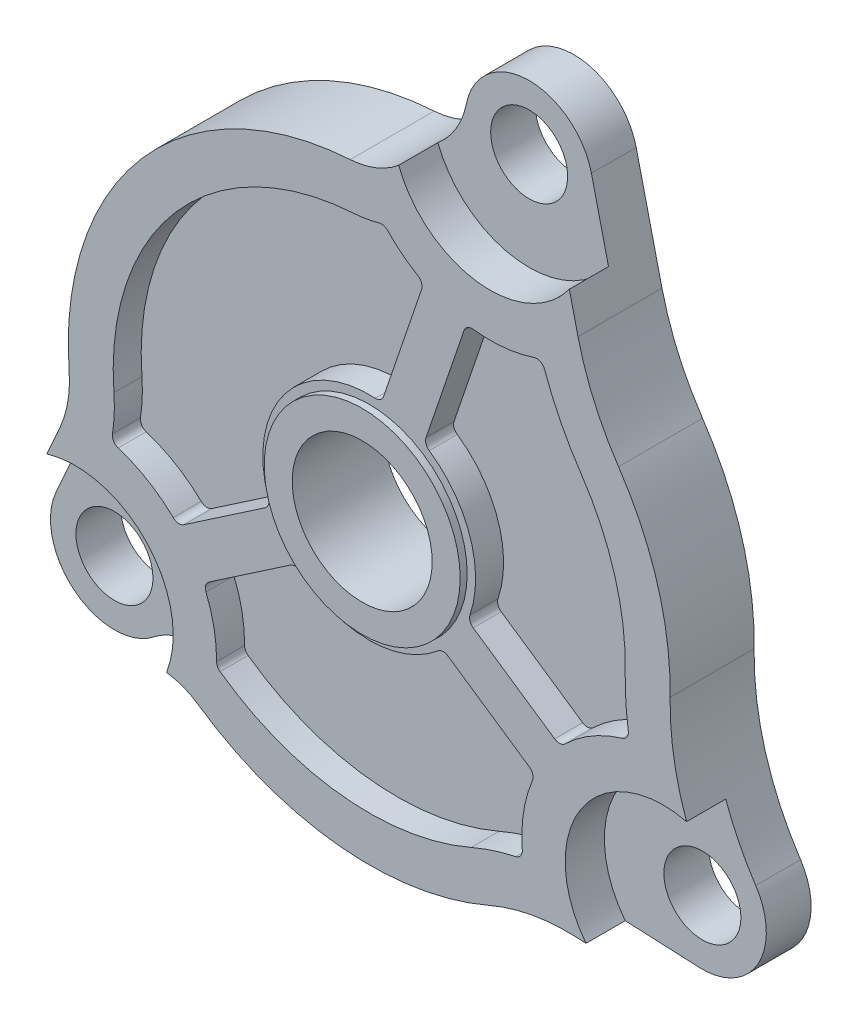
from build123d import *

# Parameters (mm, degrees)
SKETCH1_R           = 3.4925
BASE_DEPTH          = 7.62
BOSS_EXTRUDE1_REACH = 52.684
SKETCH2_R           = 8.89
RIBS_DEPTH          = 2.54
EAR_1_DEPTH         = 3.556
EAR_2_DEPTH         = 3.556
EAR_3_DEPTH         = 3.556
SKETCH7_R           = 6.35
CUT_EXTRUDE5_DEPTH  = 51.683799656


with BuildPart() as part:
    # Sketch1 → Base (new body)
    with BuildSketch(Plane.XY):
        with BuildLine():
            Line((16.604256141, 33.560634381), (18.943472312, 23.673588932))
            ThreePointArc((18.943472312, 23.673588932), (20.401103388, 19.31706117), (22.619598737, 15.294338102))
            ThreePointArc((22.619598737, 15.294338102), (26.177171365, 7.766513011), (27.300719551, -0.483463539))
            ThreePointArc((27.300719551, -0.483463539), (28.309281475, -8.033336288), (31.510952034, -14.944709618))
            ThreePointArc((31.510952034, -14.944709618), (31.716980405, -21.01221602), (26.400801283, -23.943993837))
            Line((26.400801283, -23.943993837), (18.789002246, -23.590560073))
            ThreePointArc((18.789002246, -23.590560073), (14.751162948, -23.864172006), (10.879801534, -25.043820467))
            ThreePointArc((10.879801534, -25.043820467), (-2.658121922, -27.175308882), (-15.526424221, -22.460925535))
            ThreePointArc((-15.526424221, -22.460925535), (-19.339203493, -21.337609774), (-23.072841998, -22.701086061))
            ThreePointArc((-23.072841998, -22.701086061), (-30.228876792, -22.731059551), (-31.974558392, -15.791151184))
            Line((-31.974558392, -15.791151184), (-28.068905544, -6.994505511))
            ThreePointArc((-28.068905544, -6.994505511), (-27.342210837, -4.596155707), (-27.224673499, -2.092887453))
            ThreePointArc((-27.224673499, -2.092887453), (-20.610396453, 17.910180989), (-1.725707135, 27.250412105))
            ThreePointArc((-1.725707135, 27.250412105), (2.807988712, 29.118342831), (5.264931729, 33.361807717))
            ThreePointArc((5.264931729, 33.361807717), (10.854529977, 38.027365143), (16.604256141, 33.560634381))
        make_face()
        with Locations(Location((10.956281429, 32.224357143, 0), (0, 0, 180))):
            Circle(SKETCH1_R, mode=Mode.SUBTRACT)
        with Locations(Location((-26.67, -18.146340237, 0), (0, 0, 180))):
            Circle(SKETCH1_R, mode=Mode.SUBTRACT)
        with Locations(Location((26.67, -18.146340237, 0), (0, 0, 180))):
            Circle(SKETCH1_R, mode=Mode.SUBTRACT)
    extrude(amount=BASE_DEPTH)

    # Sketch2 → Boss-Extrude1 (add, up to next)
    with BuildSketch(Plane.XY.offset(8.255), mode=Mode.PRIVATE) as boss_extrude1_sk1:
        Circle(SKETCH2_R)
    boss_extrude1_tool1 = extrude(boss_extrude1_sk1.sketch, amount=-BOSS_EXTRUDE1_REACH, mode=Mode.PRIVATE) - part.part
    add(boss_extrude1_tool1.solids().sort_by_distance((0, 0, 8.255))[0])

    # Sketch3 → Ribs (cut)
    with BuildSketch(Plane.XY.offset(7.62)):
        with BuildLine():
            Line((-16.82050136, -8.986962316), (-9.437411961, -3.963488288))
            ThreePointArc((-9.437411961, -3.963488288), (-9.143653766, -3.575903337), (-9.144158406, -3.089574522))
            ThreePointArc((-9.144158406, -3.089574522), (-7.680637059, 5.845418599), (0.541368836, 9.636805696))
            ThreePointArc((0.541368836, 9.636805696), (1.010249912, 9.765904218), (1.305549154, 10.152316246))
            Line((1.305549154, 10.152316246), (4.752490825, 20.290380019))
            ThreePointArc((4.752490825, 20.290380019), (4.745775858, 20.799887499), (4.419461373, 21.191246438))
            ThreePointArc((4.419461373, 21.191246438), (2.971516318, 22.189265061), (1.673721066, 23.375988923))
            ThreePointArc((1.673721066, 23.375988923), (1.324970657, 23.584742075), (0.91851691, 23.584511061))
            ThreePointArc((0.91851691, 23.584511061), (-0.264361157, 23.321590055), (-1.468093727, 23.182464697))
            ThreePointArc((-1.468093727, 23.182464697), (-17.533671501, 15.236545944), (-23.160568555, -1.780458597))
            ThreePointArc((-23.160568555, -1.780458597), (-23.129900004, -3.436522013), (-23.291793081, -5.084938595))
            ThreePointArc((-23.291793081, -5.084938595), (-23.187534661, -5.603558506), (-22.770748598, -5.929328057))
            ThreePointArc((-22.770748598, -5.929328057), (-20.103253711, -7.131014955), (-17.77753644, -8.906013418))
            ThreePointArc((-17.77753644, -8.906013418), (-17.313377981, -9.116251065), (-16.82050136, -8.986962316))
        make_face()
        with BuildLine():
            Line((8.600175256, 18.982167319), (5.153233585, 8.844103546))
            ThreePointArc((5.153233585, 8.844103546), (5.151801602, 8.357776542), (5.444820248, 7.969632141))
            ThreePointArc((5.444820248, 7.969632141), (9.153474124, 3.061864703), (9.144158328, -3.089574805))
            ThreePointArc((9.144158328, -3.089574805), (9.143653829, -3.575903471), (9.437411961, -3.963488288))
            Line((9.437411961, -3.963488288), (16.820501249, -8.986962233))
            ThreePointArc((16.820501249, -8.986962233), (17.313378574, -9.116251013), (17.77753741, -8.906012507))
            ThreePointArc((17.77753741, -8.906012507), (20.193990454, -7.077426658), (22.972046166, -5.866898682))
            ThreePointArc((22.972046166, -5.866898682), (23.394092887, -5.548081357), (23.506917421, -5.031323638))
            ThreePointArc((23.506917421, -5.031323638), (23.275264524, -2.726844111), (23.225262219, -0.411290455))
            ThreePointArc((23.225262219, -0.411290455), (22.269437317, 6.607126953), (19.242940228, 13.011195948))
            ThreePointArc((19.242940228, 13.011195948), (17.372981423, 16.188369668), (15.914244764, 19.574114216))
            ThreePointArc((15.914244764, 19.574114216), (15.531519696, 20.001577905), (14.959105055, 20.040886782))
            ThreePointArc((14.959105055, 20.040886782), (12.216303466, 19.462229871), (9.413298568, 19.493341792))
            ThreePointArc((9.413298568, 19.493341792), (8.916062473, 19.381990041), (8.600175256, 18.982167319))
        make_face()
        with BuildLine():
            Line((7.151258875, -7.323488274), (14.534348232, -12.346962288))
            ThreePointArc((14.534348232, -12.346962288), (14.835546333, -12.757963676), (14.810381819, -13.26689313))
            ThreePointArc((14.810381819, -13.26689313), (13.998126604, -16.175763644), (13.888681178, -19.193926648))
            ThreePointArc((13.888681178, -19.193926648), (13.741882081, -19.709272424), (13.292122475, -20.00055849))
            ThreePointArc((13.292122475, -20.00055849), (11.242161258, -20.554754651), (9.255658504, -21.305275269))
            ThreePointArc((9.255658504, -21.305275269), (-2.455638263, -23.098740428), (-13.528106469, -18.883122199))
            ThreePointArc((-13.528106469, -18.883122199), (-13.763616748, -18.608952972), (-13.846300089, -18.257104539))
            ThreePointArc((-13.846300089, -18.257104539), (-14.078649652, -15.713760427), (-14.81038135, -13.266894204))
            ThreePointArc((-14.81038135, -13.266894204), (-14.83554649, -12.757964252), (-14.534348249, -12.346962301))
            Line((-14.534348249, -12.346962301), (-7.15125892, -7.323488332))
            ThreePointArc((-7.15125892, -7.323488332), (-6.682895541, -7.19252367), (-6.230707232, -7.37152571))
            ThreePointArc((-6.230707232, -7.37152571), (1.2e-08, -9.651999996), (6.230707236, -7.371525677))
            ThreePointArc((6.230707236, -7.371525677), (6.682895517, -7.192523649), (7.151258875, -7.323488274))
        make_face()
    extrude(amount=-RIBS_DEPTH, mode=Mode.SUBTRACT)

    # Sketch4 → Ear 1 (cut)
    with BuildSketch(Plane.XY.offset(7.62)):
        with BuildLine():
            Line((18.154678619, 27.007540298), (18.154678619, 40.040057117))
            Line((18.154678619, 40.040057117), (2.671053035, 40.040057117))
            Line((2.671053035, 40.040057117), (2.671053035, 29.001456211))
            ThreePointArc((2.671053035, 29.001456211), (9.820840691, 23.407165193), (18.154678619, 27.007540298))
        make_face()
    extrude(amount=-EAR_1_DEPTH, mode=Mode.SUBTRACT)

    # Sketch5 → Ear 2 (cut)
    with BuildSketch(Plane.XY.offset(7.62)):
        with BuildLine():
            Line((37.540663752, -9.512717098), (37.540663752, -27.850835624))
            Line((37.540663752, -27.850835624), (19.674041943, -27.850835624))
            Line((19.674041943, -27.850835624), (19.674041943, -23.631654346))
            ThreePointArc((19.674041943, -23.631654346), (19.201342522, -13.324384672), (28.789587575, -9.512717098))
            Line((28.789587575, -9.512717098), (37.540663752, -9.512717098))
        make_face()
    extrude(amount=-EAR_2_DEPTH, mode=Mode.SUBTRACT)

    # Sketch6 → Ear 3 (cut)
    with BuildSketch(Plane.XY.offset(7.62)):
        with BuildLine():
            Line((-29.241937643, -9.636508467), (-37.354784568, -9.636508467))
            Line((-37.354784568, -9.636508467), (-37.354784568, -30.196246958))
            Line((-37.354784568, -30.196246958), (-20.617156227, -30.196246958))
            Line((-20.617156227, -30.196246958), (-20.617156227, -25.655566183))
            ThreePointArc((-20.617156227, -25.655566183), (-20.457991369, -24.783962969), (-20.001042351, -24.024869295))
            ThreePointArc((-20.001042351, -24.024869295), (-19.189851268, -13.342230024), (-29.241937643, -9.636508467))
        make_face()
    extrude(amount=-EAR_3_DEPTH, mode=Mode.SUBTRACT)

    # Sketch7 → Cut-Extrude5 (cut, through all)
    with BuildSketch(Plane.XY.offset(8.255)):
        Circle(SKETCH7_R)
    extrude(amount=-CUT_EXTRUDE5_DEPTH, mode=Mode.SUBTRACT)


solid = part.part
